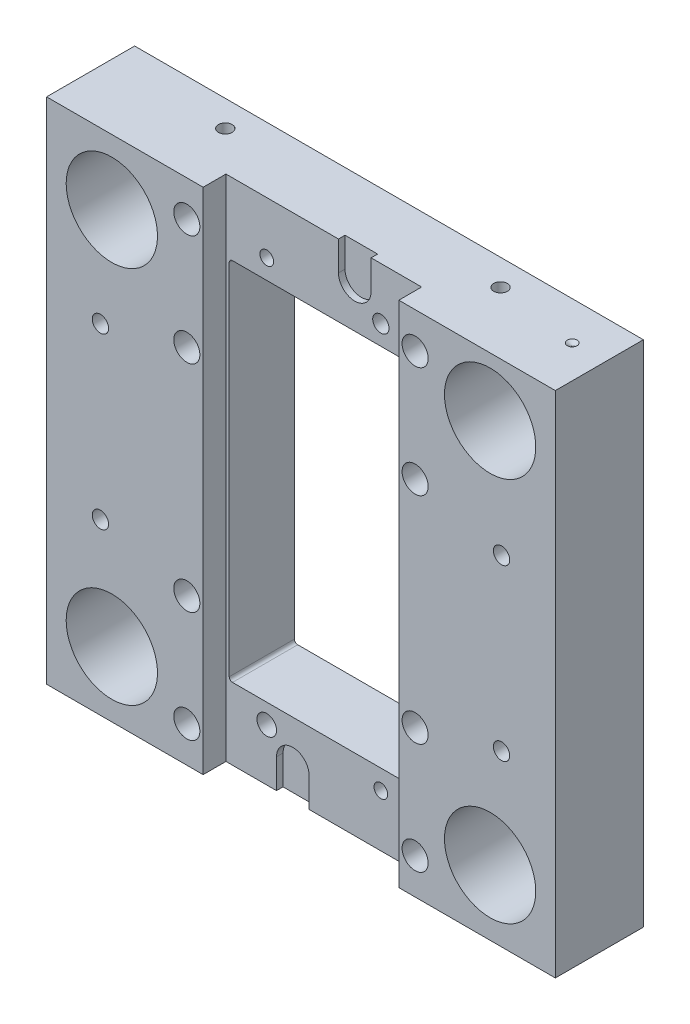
from build123d import *

# Parameters (mm, degrees)
EXTRUSION1_DEPTH                  = 78
EXTRUSION1_DEPTH_BACK             = 78
ESQUISSE2_R                       = 14
ENL_V_MAT_EXTRU_1_DEPTH           = 27
ESQUISSE3_R                       = 14
ENL_V_MAT_EXTRU_2_DEPTH           = 27
ESQUISSE4_R                       = 14
ENL_V_MAT_EXTRU_3_DEPTH           = 27
ESQUISSE5_R                       = 14
ENL_V_MAT_EXTRU_4_DEPTH           = 27
ESQUISSE6_R                       = 4
ENL_V_MAT_EXTRU_5_DEPTH           = 27
ESQUISSE7_R                       = 4
ENL_V_MAT_EXTRU_6_DEPTH           = 27
ESQUISSE8_R                       = 4
ENL_V_MAT_EXTRU_7_DEPTH           = 27
ESQUISSE9_R                       = 4
ENL_V_MAT_EXTRU_8_DEPTH           = 27
ESQUISSE10_R                      = 4
ENL_V_MAT_EXTRU_9_DEPTH           = 27
ESQUISSE11_R                      = 4
ENL_V_MAT_EXTRU_10_DEPTH          = 27
ESQUISSE12_R                      = 4
ENL_V_MAT_EXTRU_11_DEPTH          = 27
ESQUISSE13_R                      = 4
ENL_V_MAT_EXTRU_12_DEPTH          = 27
ESQUISSE14_R                      = 2.5035
ESQUISSE14_R_2                    = 3.0035
ENL_V_MAT_EXTRU_13_DEPTH          = 114.564959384
TROU_TARAUD_M5X0_81_D             = 4.2
TROU_TARAUD_M5X0_83_D             = 5
CHANFREIN1_SIZE                   = 0.5
ENL_V_MAT_EXTRU_14_DEPTH          = 2
TROU_TARAUD_M5X0_84_D             = 4.2
TROU_TARAUD_M5X0_84_DEPTH         = 12.4
TROU_TARAUD_M5X0_84_TIP           = 1.2618073
TROU_TARAUD_M5X0_85_D             = 4.2
TROU_TARAUD_M5X0_85_DEPTH         = 12.4
TROU_TARAUD_M5X0_85_TIP           = 1.2618073
DIAM_TRE_DU_PER_AGE_3_0_3_1_D     = 3
DIAM_TRE_DU_PER_AGE_3_0_3_1_DEPTH = 0.001
DIAM_TRE_DU_PER_AGE_3_0_3_1_TIP   = 0.901290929


with BuildPart() as part:
    # Esquisse1 → Extrusion1 (new, two sides: drawn at the far end of the back side and taken through both)
    with BuildSketch(Plane(origin=(0, 0, 0), x_dir=(1, 0, 0), z_dir=(0, 1, 0)).offset(-EXTRUSION1_DEPTH_BACK)):
        Polygon((-78, 0), (-30, 0), (-30, 7), (30, 7), (30, 0), (78, 0), (78, 27), (-78, 27), align=None)
    extrude(amount=EXTRUSION1_DEPTH + EXTRUSION1_DEPTH_BACK)

    # Esquisse2 → Enl_v. mat.-Extru.1 (cut)
    with BuildSketch(Plane(origin=(0, 0, -27), x_dir=(-1, 0, 0), z_dir=(0, 0, -1))):
        with Locations((-58, 60)):
            Circle(ESQUISSE2_R)
    extrude(amount=-ENL_V_MAT_EXTRU_1_DEPTH, mode=Mode.SUBTRACT)

    # Esquisse3 → Enl_v. mat.-Extru.2 (cut)
    with BuildSketch(Plane(origin=(0, 0, -27), x_dir=(-1, 0, 0), z_dir=(0, 0, -1))):
        with Locations((58, 58)):
            Circle(ESQUISSE3_R)
    extrude(amount=-ENL_V_MAT_EXTRU_2_DEPTH, mode=Mode.SUBTRACT)

    # Esquisse4 → Enl_v. mat.-Extru.3 (cut)
    with BuildSketch(Plane(origin=(0, 0, -27), x_dir=(-1, 0, 0), z_dir=(0, 0, -1))):
        with Locations((58, -58)):
            Circle(ESQUISSE4_R)
    extrude(amount=-ENL_V_MAT_EXTRU_3_DEPTH, mode=Mode.SUBTRACT)

    # Esquisse5 → Enl_v. mat.-Extru.4 (cut)
    with BuildSketch(Plane(origin=(0, 0, -27), x_dir=(-1, 0, 0), z_dir=(0, 0, -1))):
        with Locations((-58, -58)):
            Circle(ESQUISSE5_R)
    extrude(amount=-ENL_V_MAT_EXTRU_4_DEPTH, mode=Mode.SUBTRACT)

    # Esquisse6 → Enl_v. mat.-Extru.5 (cut)
    with BuildSketch(Plane(origin=(0, 0, -27), x_dir=(-1, 0, 0), z_dir=(0, 0, -1))):
        with Locations((-35, 67)):
            Circle(ESQUISSE6_R)
    extrude(amount=-ENL_V_MAT_EXTRU_5_DEPTH, mode=Mode.SUBTRACT)

    # Esquisse7 → Enl_v. mat.-Extru.6 (cut)
    with BuildSketch(Plane(origin=(0, 0, -27), x_dir=(-1, 0, 0), z_dir=(0, 0, -1))):
        with Locations((35, 67)):
            Circle(ESQUISSE7_R)
    extrude(amount=-ENL_V_MAT_EXTRU_6_DEPTH, mode=Mode.SUBTRACT)

    # Esquisse8 → Enl_v. mat.-Extru.7 (cut)
    with BuildSketch(Plane(origin=(0, 0, -27), x_dir=(-1, 0, 0), z_dir=(0, 0, -1))):
        with Locations((-35, -67)):
            Circle(ESQUISSE8_R)
    extrude(amount=-ENL_V_MAT_EXTRU_7_DEPTH, mode=Mode.SUBTRACT)

    # Esquisse9 → Enl_v. mat.-Extru.8 (cut)
    with BuildSketch(Plane(origin=(0, 0, -27), x_dir=(-1, 0, 0), z_dir=(0, 0, -1))):
        with Locations((35, -67)):
            Circle(ESQUISSE9_R)
    extrude(amount=-ENL_V_MAT_EXTRU_8_DEPTH, mode=Mode.SUBTRACT)

    # Esquisse10 → Enl_v. mat.-Extru.9 (cut)
    with BuildSketch(Plane(origin=(0, 0, -27), x_dir=(-1, 0, 0), z_dir=(0, 0, -1))):
        with Locations((-35, 33)):
            Circle(ESQUISSE10_R)
    extrude(amount=-ENL_V_MAT_EXTRU_9_DEPTH, mode=Mode.SUBTRACT)

    # Esquisse11 → Enl_v. mat.-Extru.10 (cut)
    with BuildSketch(Plane(origin=(0, 0, -27), x_dir=(-1, 0, 0), z_dir=(0, 0, -1))):
        with Locations((-35, -33)):
            Circle(ESQUISSE11_R)
    extrude(amount=-ENL_V_MAT_EXTRU_10_DEPTH, mode=Mode.SUBTRACT)

    # Esquisse12 → Enl_v. mat.-Extru.11 (cut)
    with BuildSketch(Plane(origin=(0, 0, -27), x_dir=(-1, 0, 0), z_dir=(0, 0, -1))):
        with Locations((35, -33)):
            Circle(ESQUISSE12_R)
    extrude(amount=-ENL_V_MAT_EXTRU_11_DEPTH, mode=Mode.SUBTRACT)

    # Esquisse13 → Enl_v. mat.-Extru.12 (cut)
    with BuildSketch(Plane(origin=(0, 0, -27), x_dir=(-1, 0, 0), z_dir=(0, 0, -1))):
        with Locations((35, 33)):
            Circle(ESQUISSE13_R)
    extrude(amount=-ENL_V_MAT_EXTRU_12_DEPTH, mode=Mode.SUBTRACT)

    # Esquisse14 → Enl_v. mat.-Extru.13 (cut, through all)
    with BuildSketch(Plane.XY):
        with Locations((17.5, 62)):
            Circle(ESQUISSE14_R)
        with Locations((-17.5, -62)):
            Circle(ESQUISSE14_R_2)
        with BuildLine():
            Line((28, 56), (-28, 56))
            ThreePointArc((-28, 56), (-28.707106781, 55.707106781), (-29, 55))
            Line((-29, 55), (-29, -55))
            ThreePointArc((-29, -55), (-28.707106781, -55.707106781), (-28, -56))
            Line((-28, -56), (28, -56))
            ThreePointArc((28, -56), (28.707106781, -55.707106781), (29, -55))
            Line((29, -55), (29, 55))
            ThreePointArc((29, 55), (28.707106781, 55.707106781), (28, 56))
        make_face()
    extrude(amount=-ENL_V_MAT_EXTRU_13_DEPTH, mode=Mode.SUBTRACT)

    # Trou taraud_ M5x0.81 (through all)
    with Locations(Plane(origin=(17.5, -62, -27), x_dir=(-1, 0, 0), z_dir=(0, 0, -1))):
        with Locations((0, 0), (35, 124)):
            Hole(TROU_TARAUD_M5X0_81_D / 2)

    # Trou taraud_ M5x0.83 (through all)
    with Locations(Plane(origin=(0, 0, -27), x_dir=(-1, 0, 0), z_dir=(0, 0, -1))):
        with Locations((-61.5, -26), (-61.5, 26), (61.5, -26), (61.5, 26)):
            Hole(TROU_TARAUD_M5X0_83_D / 2)

    # Chanfrein1
    chanfrein1_edges = [part.edges().sort_by_distance(p)[0] for p in [
        (-64, 26, -27),
        (-64, -26, -27),
        (59, 26, -27),
        (59, -26, -27),
    ]]
    chamfer(chanfrein1_edges, length=CHANFREIN1_SIZE)

    # Esquisse22 → Enl_v. mat.-Extru.14 (cut)
    with BuildSketch(Plane.XY.offset(-7)):
        with BuildLine():
            Line((4.5, 78), (4.5, 69))
            ThreePointArc((4.5, 69), (9.5, 64), (14.5, 69))
            Line((14.5, 69), (14.5, 78))
            Line((14.5, 78), (4.5, 78))
        make_face()
        with BuildLine():
            Line((-14.5, -69), (-14.5, -78))
            Line((-14.5, -78), (-4.5, -78))
            Line((-4.5, -78), (-4.5, -69))
            ThreePointArc((-4.5, -69), (-9.5, -64), (-14.5, -69))
        make_face()
    extrude(amount=-ENL_V_MAT_EXTRU_14_DEPTH, mode=Mode.SUBTRACT)

    # Trou taraud_ M5x0.84
    with Locations(Plane.XZ.offset(78)):
        with Locations((42.2, -19), (-42.2, -19)):
            Hole(TROU_TARAUD_M5X0_84_D / 2, depth=TROU_TARAUD_M5X0_84_DEPTH)
            with Locations((0, 0, -(TROU_TARAUD_M5X0_84_DEPTH + TROU_TARAUD_M5X0_84_TIP / 2))):  # 118° drill point
                Cone(0, TROU_TARAUD_M5X0_84_D / 2, TROU_TARAUD_M5X0_84_TIP, mode=Mode.SUBTRACT)

    # Trou taraud_ M5x0.85
    with Locations(Plane(origin=(0, 78, 0), x_dir=(-1, 0, 0), z_dir=(0, 1, 0))):
        with Locations((-42.2, -19), (42.2, -19)):
            Hole(TROU_TARAUD_M5X0_85_D / 2, depth=TROU_TARAUD_M5X0_85_DEPTH)
            with Locations((0, 0, -(TROU_TARAUD_M5X0_85_DEPTH + TROU_TARAUD_M5X0_85_TIP / 2))):  # 118° drill point
                Cone(0, TROU_TARAUD_M5X0_85_D / 2, TROU_TARAUD_M5X0_85_TIP, mode=Mode.SUBTRACT)

    # Diam_tre du per_age _3.0 _3_1
    with Locations(Plane(origin=(0, 78, 0), x_dir=(-1, 0, 0), z_dir=(0, 1, 0))):
        with Locations((-67.937015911, -15.229238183)):
            Hole(DIAM_TRE_DU_PER_AGE_3_0_3_1_D / 2, depth=DIAM_TRE_DU_PER_AGE_3_0_3_1_DEPTH)
            with Locations((0, 0, -(DIAM_TRE_DU_PER_AGE_3_0_3_1_DEPTH + DIAM_TRE_DU_PER_AGE_3_0_3_1_TIP / 2))):  # 118° drill point
                Cone(0, DIAM_TRE_DU_PER_AGE_3_0_3_1_D / 2, DIAM_TRE_DU_PER_AGE_3_0_3_1_TIP, mode=Mode.SUBTRACT)


solid = part.part
